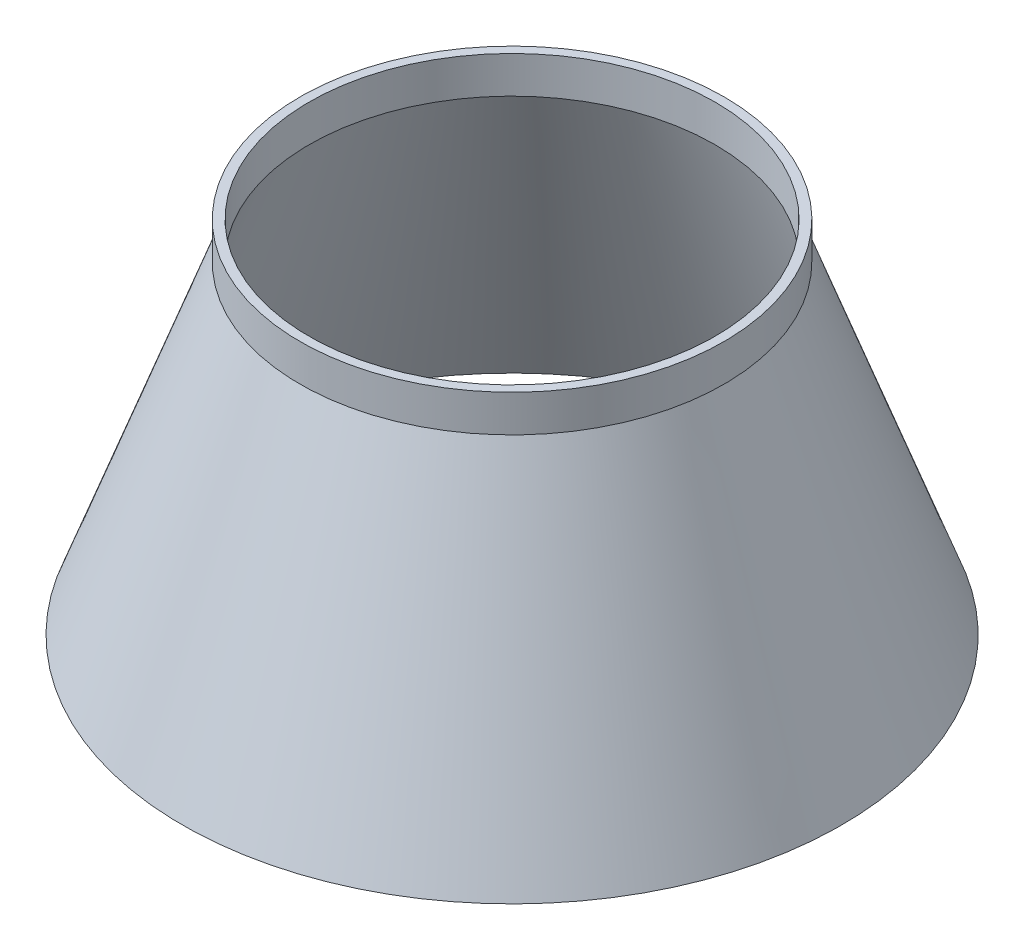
from build123d import *


with BuildPart() as part:
    # Sketch 1 → Revolve 1 (revolve)
    with BuildSketch(Plane.XY, mode=Mode.PRIVATE) as revolve_1_sk:
        Polygon((45, 79.8), (47, 79.8), (47, 71.609322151), (73.063661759, 0), (71.063661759, 0), (45, 71.609322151), align=None)
    revolve(revolve_1_sk.sketch.rotate(Axis((0, 0, 0), (0, 1, 0)), 90), axis=Axis((0, 0, 0), (0, 1, 0)))


solid = part.part
